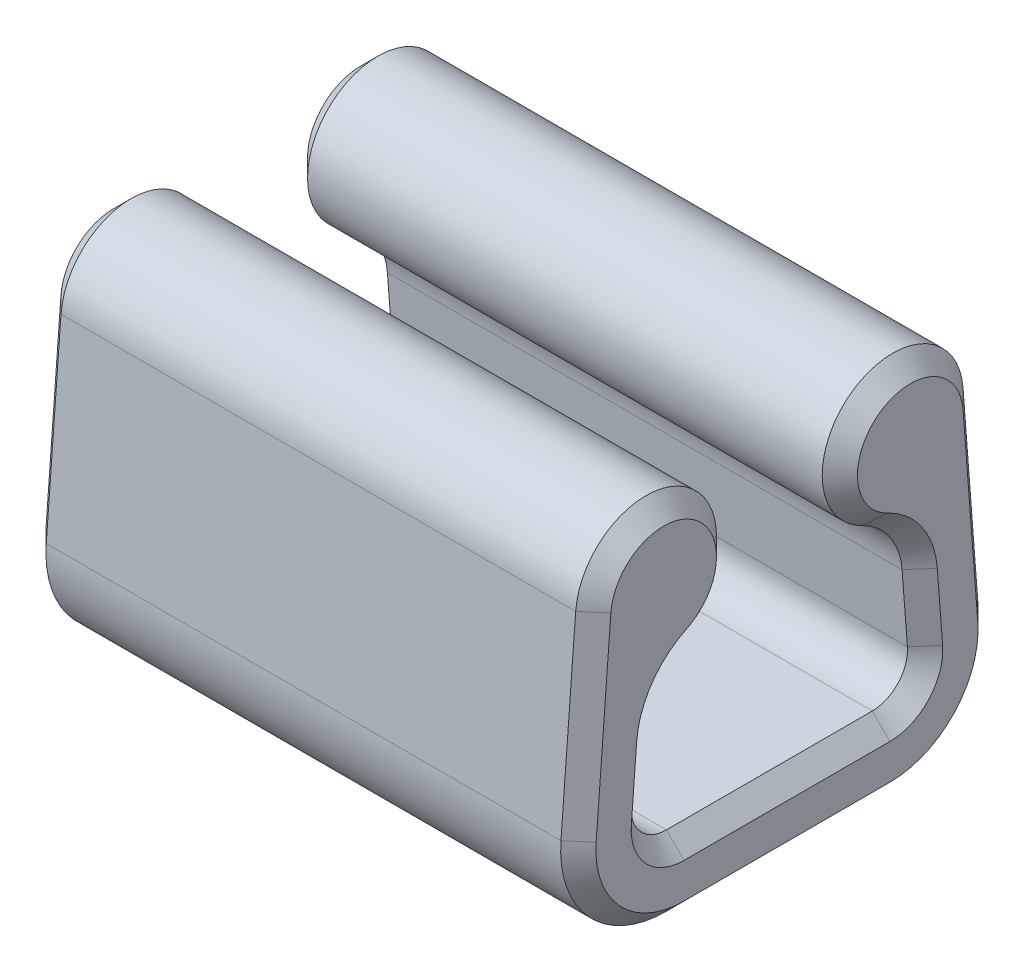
from build123d import *

# Parameters (mm, degrees)
BOSS_EXTRU_1_DEPTH = 7.8
CHANFREIN1_SIZE    = 0.5


with BuildPart() as part:
    # Esquisse1 → Boss.-Extru.1 (new, symmetric)
    with BuildSketch(Plane(origin=(0, 0, 0), x_dir=(0, 0, -1), z_dir=(1, 0, 0))):
        with BuildLine():
            Line((0, 0), (2.92, 0))
            ThreePointArc((2.92, 0), (5.121189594, 0.961676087), (5.911158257, 3.230157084))
            Line((5.911158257, 3.230157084), (5.493806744, 8.654124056))
            ThreePointArc((5.493806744, 8.654124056), (2.369767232, 10.150912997), (2.635529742, 6.697020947))
            ThreePointArc((2.635529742, 6.697020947), (3.421585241, 6.023289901), (3.765463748, 5.046793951))
            Line((3.765463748, 5.046793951), (3.917052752, 3.076719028))
            ThreePointArc((3.917052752, 3.076719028), (3.653729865, 2.320558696), (2.92, 2))
            Line((2.92, 2), (0, 2))
            Line((0, 2), (0, 0))
        make_face()
    boss_extru_1 = extrude(amount=BOSS_EXTRU_1_DEPTH, both=True)

    # Sym_trie1: Boss.-Extru.1 across plane
    add(boss_extru_1.mirror(Plane.XY))

    # Chanfrein1
    chanfrein1_edges = [part.edges().sort_by_distance(p)[0] for p in [
        (-7.8, 4.06175649, -3.84125825),
        (-7.8, 6.023289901, -3.421585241),
        (-7.8, 10.150912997, -2.369767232),
        (-7.8, 5.94214057, -5.7024825),
        (-7.8, 0.961676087, -5.121189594),
        (-7.8, 0, 0),
        (7.8, 0.961676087, -5.121189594),
        (7.8, 5.94214057, -5.7024825),
        (7.8, 10.150912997, -2.369767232),
        (7.8, 6.023289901, -3.421585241),
        (7.8, 2.320558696, 3.653729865),
        (7.8, 4.06175649, -3.84125825),
        (7.8, 4.06175649, 3.84125825),
        (7.8, 6.023289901, 3.421585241),
        (7.8, 10.150912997, 2.369767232),
        (7.8, 5.94214057, 5.7024825),
        (7.8, 0.961676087, 5.121189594),
        (-7.8, 0.961676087, 5.121189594),
        (-7.8, 5.94214057, 5.7024825),
        (-7.8, 10.150912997, 2.369767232),
        (7.8, 2.320558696, -3.653729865),
        (-7.8, 6.023289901, 3.421585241),
        (-7.8, 4.06175649, 3.84125825),
        (-7.8, 2.320558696, 3.653729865),
        (7.8, 2, 0),
        (7.8, 0, 0),
        (-7.8, 2, 0),
        (-7.8, 2.320558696, -3.653729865),
    ]]
    chamfer(chanfrein1_edges, length=CHANFREIN1_SIZE)


solid = part.part
